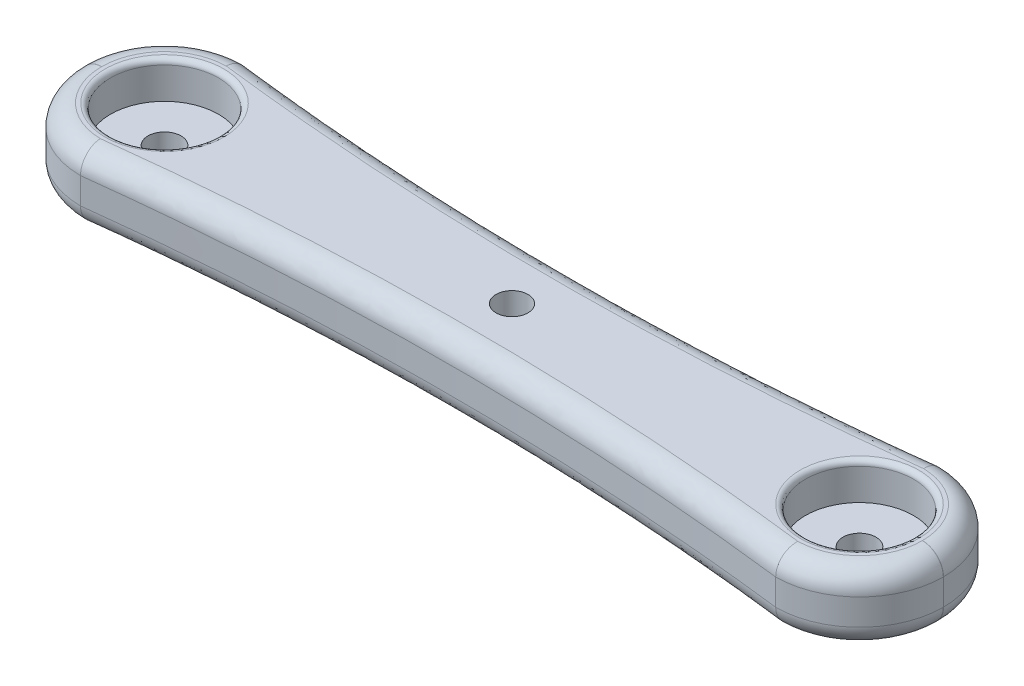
from build123d import *

# Parameters (mm, degrees)
SKETCH1_R           = 5.15
SKETCH1_R_2         = 1.525
BOSS_EXTRUDE1_DEPTH = 6.5
SKETCH1_3_R         = 5.15
SKETCH1_3_R_2       = 1.575
BOSS_EXTRUDE2_DEPTH = 3
FILLET1_R           = 2
FILLET2_R           = 0.5


with BuildPart() as part:
    # Sketch1 → Boss-Extrude1 (new body)
    with BuildSketch(Plane(origin=(0, 0, 0), x_dir=(1, 0, 0), z_dir=(0, 1, 0))):
        with BuildLine():
            Line((-41.13, -0.01), (-41.13, 0.01))
            ThreePointArc((-41.13, 0.01), (-38.789783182, 5.659783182), (-33.14, 8))
            add(Edge.make_bspline(
                [(-33.14, 8), (0, 4), (33.14, 8)],
                knots=[0, 0, 0, 1, 1, 1], degree=2))
            ThreePointArc((33.14, 8), (38.789783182, 5.659783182), (41.13, 0.01))
            Line((41.13, 0.01), (41.13, -0.01))
            ThreePointArc((41.13, -0.01), (38.789783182, -5.659783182), (33.14, -8))
            add(Edge.make_bspline(
                [(-33.14, -8), (0, -4), (33.14, -8)],
                knots=[0, 0, 0, 1, 1, 1], degree=2))
            ThreePointArc((-33.14, -8), (-38.789783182, -5.659783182), (-41.13, -0.01))
        make_face()
        with Locations(Location((-33.13, 0, 0), (0, 0, 90))):
            Circle(SKETCH1_R, mode=Mode.SUBTRACT)
        with Locations(Location((33.13, 0, 0), (0, 0, 90))):
            Circle(SKETCH1_R, mode=Mode.SUBTRACT)
        with Locations(Location((0, 0, 0), (0, 0, 90))):
            Circle(SKETCH1_R_2, mode=Mode.SUBTRACT)
    extrude(amount=BOSS_EXTRUDE1_DEPTH)

    # Sketch1_3 → Boss-Extrude2 (add)
    # profile 1 of 2: a face of its own
    with BuildSketch(Plane(origin=(0, 0, 0), x_dir=(1, 0, 0), z_dir=(0, 1, 0))):
        with Locations(Location((33.13, 0, 0), (0, 0, 90))):
            Circle(SKETCH1_3_R)
        with Locations(Location((33.13, 0, 0), (0, 0, 270))):
            Circle(SKETCH1_3_R_2, mode=Mode.SUBTRACT)
    # profile 2 of 2: a face of its own
    with BuildSketch(Plane(origin=(0, 0, 0), x_dir=(1, 0, 0), z_dir=(0, 1, 0))):
        with Locations(Location((-33.13, 0, 0), (0, 0, 90))):
            Circle(SKETCH1_3_R)
        with Locations(Location((-33.13, 0, 0), (0, 0, 270))):
            Circle(SKETCH1_3_R_2, mode=Mode.SUBTRACT)
    extrude(amount=BOSS_EXTRUDE2_DEPTH)

    # Fillet1
    fillet1_edges = [part.edges().sort_by_distance(p)[0] for p in [
        (-41.13, 0, 0),
        (-38.789783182, 0, -5.659783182),
        (0, 0, -6),
        (38.789783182, 0, -5.659783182),
        (41.13, 0, 0),
        (38.789783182, 0, 5.659783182),
        (0, 0, 6),
        (-38.789783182, 0, 5.659783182),
        (-38.789783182, 6.5, 5.659783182),
        (0, 6.5, 6),
        (38.789783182, 6.5, 5.659783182),
        (41.13, 6.5, 0),
        (38.789783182, 6.5, -5.659783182),
        (0, 6.5, -6),
        (-38.789783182, 6.5, -5.659783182),
        (-41.13, 6.5, 0),
    ]]
    fillet(fillet1_edges, radius=FILLET1_R)

    # Fillet2
    fillet2_edges = [part.edges().sort_by_distance(p)[0] for p in [
        (-33.13, 6.5, 5.15),
        (33.13, 6.5, 5.15),
    ]]
    fillet(fillet2_edges, radius=FILLET2_R)


solid = part.part
